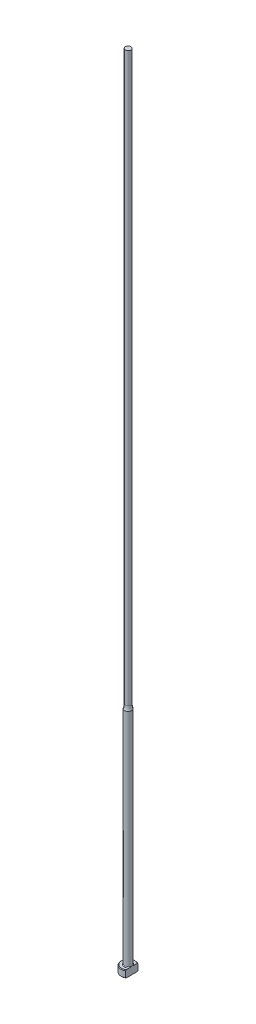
ISO-10303-21;
HEADER;
FILE_DESCRIPTION(('STEP AP214'),'2;1');
FILE_NAME('part.step','',(''),(''),'','','');
FILE_SCHEMA(('AUTOMOTIVE_DESIGN { 1 0 10303 214 1 1 1 1 }'));
ENDSEC;
DATA;
#1=APPLICATION_CONTEXT('core data for automotive mechanical design processes');
#2=APPLICATION_PROTOCOL_DEFINITION('international standard','automotive_design',2000,#1);
#3=PRODUCT_CONTEXT('',#1,'mechanical');
#4=PRODUCT('Part','Part','',(#3));
#5=PRODUCT_RELATED_PRODUCT_CATEGORY('part','',(#4));
#6=PRODUCT_DEFINITION_FORMATION('','',#4);
#7=PRODUCT_DEFINITION_CONTEXT('part definition',#1,'design');
#8=PRODUCT_DEFINITION('design','',#6,#7);
#9=PRODUCT_DEFINITION_SHAPE('','',#8);
#10=(LENGTH_UNIT() NAMED_UNIT(*) SI_UNIT(.MILLI.,.METRE.));
#11=(NAMED_UNIT(*) PLANE_ANGLE_UNIT() SI_UNIT($,.RADIAN.));
#12=(NAMED_UNIT(*) SI_UNIT($,.STERADIAN.) SOLID_ANGLE_UNIT());
#13=UNCERTAINTY_MEASURE_WITH_UNIT(LENGTH_MEASURE(1.E-05),#10,'distance_accuracy_value','');
#14=(GEOMETRIC_REPRESENTATION_CONTEXT(3) GLOBAL_UNCERTAINTY_ASSIGNED_CONTEXT((#13)) GLOBAL_UNIT_ASSIGNED_CONTEXT((#10,
#11,#12)) REPRESENTATION_CONTEXT('',''));
#15=CARTESIAN_POINT('',(0.,0.,0.));
#16=DIRECTION('',(0.,0.,1.));
#17=DIRECTION('',(1.,0.,0.));
#18=AXIS2_PLACEMENT_3D('',#15,#16,#17);
#19=CARTESIAN_POINT('',(-3.17499999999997,3.175,0.));
#20=DIRECTION('',(0.,1.,0.));
#21=DIRECTION('',(0.,0.,1.));
#22=AXIS2_PLACEMENT_3D('',#19,#20,#21);
#23=PLANE('',#22);
#24=CARTESIAN_POINT('',(0.,3.175,0.));
#25=DIRECTION('',(0.,1.,0.));
#26=DIRECTION('',(0.,0.,1.));
#27=AXIS2_PLACEMENT_3D('',#24,#25,#26);
#28=CIRCLE('',#27,2.92099999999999);
#29=CARTESIAN_POINT('',(1.58749999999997,3.175,-2.4519552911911));
#30=VERTEX_POINT('',#29);
#31=CARTESIAN_POINT('',(1.58749999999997,3.175,2.4519552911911));
#32=VERTEX_POINT('',#31);
#33=EDGE_CURVE('E105',#30,#32,#28,.T.);
#34=ORIENTED_EDGE('',*,*,#33,.T.);
#35=DIRECTION('',(0.,0.,1.));
#36=VECTOR('',#35,1.);
#37=CARTESIAN_POINT('',(1.58749999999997,3.17499999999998,2.74963065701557));
#38=LINE('',#37,#36);
#39=CARTESIAN_POINT('',(1.58749999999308,3.175,0.933255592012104));
#40=VERTEX_POINT('',#39);
#41=EDGE_CURVE('E126',#40,#32,#38,.T.);
#42=ORIENTED_EDGE('',*,*,#41,.F.);
#43=CARTESIAN_POINT('',(0.,3.175,0.));
#44=DIRECTION('',(0.,1.,0.));
#45=DIRECTION('',(0.,0.,1.));
#46=AXIS2_PLACEMENT_3D('',#43,#44,#45);
#47=CIRCLE('',#46,1.84149999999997);
#48=CARTESIAN_POINT('',(1.58749999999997,3.17500000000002,-0.933255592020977));
#49=VERTEX_POINT('',#48);
#50=EDGE_CURVE('E11',#40,#49,#47,.F.);
#51=ORIENTED_EDGE('',*,*,#50,.T.);
#52=EDGE_CURVE('E52',#30,#49,#38,.T.);
#53=ORIENTED_EDGE('',*,*,#52,.F.);
#54=EDGE_LOOP('',(#34,#42,#51,#53));
#55=FACE_BOUND('',#54,.T.);
#56=ADVANCED_FACE('F32',(#55),#23,.T.);
#57=CARTESIAN_POINT('',(0.,259.958771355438,0.));
#58=DIRECTION('',(0.,1.,0.));
#59=DIRECTION('',(0.,0.,1.));
#60=AXIS2_PLACEMENT_3D('',#57,#58,#59);
#61=CYLINDRICAL_SURFACE('',#60,3.17499999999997);
#62=CARTESIAN_POINT('',(0.,2.92100000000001,0.));
#63=DIRECTION('',(0.,1.,0.));
#64=DIRECTION('',(0.,0.,1.));
#65=AXIS2_PLACEMENT_3D('',#62,#63,#64);
#66=CIRCLE('',#65,3.17499999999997);
#67=CARTESIAN_POINT('',(1.58749999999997,2.92100000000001,2.74963065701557));
#68=VERTEX_POINT('',#67);
#69=CARTESIAN_POINT('',(1.58749999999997,2.92100000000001,-2.74963065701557));
#70=VERTEX_POINT('',#69);
#71=EDGE_CURVE('E98',#68,#70,#66,.F.);
#72=ORIENTED_EDGE('',*,*,#71,.T.);
#73=DIRECTION('',(0.,-1.,0.));
#74=VECTOR('',#73,1.);
#75=CARTESIAN_POINT('',(1.58749999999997,355.601,-2.74963065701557));
#76=LINE('',#75,#74);
#77=CARTESIAN_POINT('',(1.58749999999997,0.253999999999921,-2.74963065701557));
#78=VERTEX_POINT('',#77);
#79=EDGE_CURVE('E141',#70,#78,#76,.T.);
#80=ORIENTED_EDGE('',*,*,#79,.T.);
#81=CARTESIAN_POINT('',(0.,0.253999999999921,0.));
#82=DIRECTION('',(0.,-1.,0.));
#83=DIRECTION('',(0.,0.,-1.));
#84=AXIS2_PLACEMENT_3D('',#81,#82,#83);
#85=CIRCLE('',#84,3.17499999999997);
#86=CARTESIAN_POINT('',(1.58749999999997,0.253999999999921,2.74963065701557));
#87=VERTEX_POINT('',#86);
#88=EDGE_CURVE('E95',#78,#87,#85,.F.);
#89=ORIENTED_EDGE('',*,*,#88,.T.);
#90=DIRECTION('',(0.,-1.,0.));
#91=VECTOR('',#90,1.);
#92=CARTESIAN_POINT('',(1.58749999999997,355.601,2.74963065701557));
#93=LINE('',#92,#91);
#94=EDGE_CURVE('E88',#68,#87,#93,.T.);
#95=ORIENTED_EDGE('',*,*,#94,.F.);
#96=EDGE_LOOP('',(#72,#80,#89,#95));
#97=FACE_BOUND('',#96,.T.);
#98=ADVANCED_FACE('F191',(#97),#61,.T.);
#99=CARTESIAN_POINT('',(0.,0.,0.));
#100=DIRECTION('',(0.,-1.,0.));
#101=DIRECTION('',(0.,0.,-1.));
#102=AXIS2_PLACEMENT_3D('',#99,#100,#101);
#103=PLANE('',#102);
#104=CARTESIAN_POINT('',(0.,0.,0.));
#105=DIRECTION('',(0.,-1.,0.));
#106=DIRECTION('',(0.,0.,-1.));
#107=AXIS2_PLACEMENT_3D('',#104,#105,#106);
#108=CIRCLE('',#107,2.92100000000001);
#109=CARTESIAN_POINT('',(1.58749999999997,0.,2.45195529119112));
#110=VERTEX_POINT('',#109);
#111=CARTESIAN_POINT('',(1.58749999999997,0.,-2.45195529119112));
#112=VERTEX_POINT('',#111);
#113=EDGE_CURVE('E93',#110,#112,#108,.T.);
#114=ORIENTED_EDGE('',*,*,#113,.T.);
#115=DIRECTION('',(0.,0.,1.));
#116=VECTOR('',#115,1.);
#117=CARTESIAN_POINT('',(1.58749999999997,0.,2.74963065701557));
#118=LINE('',#117,#116);
#119=EDGE_CURVE('E78',#112,#110,#118,.T.);
#120=ORIENTED_EDGE('',*,*,#119,.T.);
#121=EDGE_LOOP('',(#114,#120));
#122=FACE_BOUND('',#121,.T.);
#123=ADVANCED_FACE('F97',(#122),#103,.T.);
#124=CARTESIAN_POINT('',(0.,3.17499999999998,0.));
#125=DIRECTION('',(0.,-1.,0.));
#126=DIRECTION('',(0.,0.,-1.));
#127=AXIS2_PLACEMENT_3D('',#124,#125,#126);
#128=CONICAL_SURFACE('',#127,2.92100000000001,0.785398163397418);
#129=ORIENTED_EDGE('',*,*,#71,.F.);
#130=CARTESIAN_POINT('',(1.58749999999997,-0.161620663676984,-6.0529050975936));
#131=CARTESIAN_POINT('',(1.58749999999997,-0.0288893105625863,-5.91567682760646));
#132=CARTESIAN_POINT('',(1.58749999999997,0.103699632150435,-5.77831035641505));
#133=CARTESIAN_POINT('',(1.58749999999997,0.368508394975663,-5.50321874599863));
#134=CARTESIAN_POINT('',(1.58749999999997,0.5007282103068,-5.3654936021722));
#135=CARTESIAN_POINT('',(1.58749999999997,0.764778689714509,-5.08953516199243));
#136=CARTESIAN_POINT('',(1.58749999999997,0.896609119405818,-4.95130164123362));
#137=CARTESIAN_POINT('',(1.58749999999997,1.15968706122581,-4.67428233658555));
#138=CARTESIAN_POINT('',(1.58749999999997,1.29093457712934,-4.5354965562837));
#139=CARTESIAN_POINT('',(1.58749999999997,1.55007705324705,-4.25997724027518));
#140=CARTESIAN_POINT('',(1.58749999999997,1.67798684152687,-4.12325766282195));
#141=CARTESIAN_POINT('',(1.58749999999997,1.9328486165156,-3.84892898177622));
#142=CARTESIAN_POINT('',(1.58749999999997,2.05980060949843,-3.71131988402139));
#143=CARTESIAN_POINT('',(1.58749999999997,2.31237508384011,-3.43493978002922));
#144=CARTESIAN_POINT('',(1.58749999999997,2.43799784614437,-3.29616903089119));
#145=CARTESIAN_POINT('',(1.58749999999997,2.68741369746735,-3.01699558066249));
#146=CARTESIAN_POINT('',(1.58749999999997,2.81120686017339,-2.8765929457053));
#147=CARTESIAN_POINT('',(1.58749999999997,3.00875865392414,-2.64816703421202));
#148=CARTESIAN_POINT('',(1.58749999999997,3.08336151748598,-2.56087478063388));
#149=CARTESIAN_POINT('',(1.58749999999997,3.23123871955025,-2.385154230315));
#150=CARTESIAN_POINT('',(1.58749999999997,3.30451292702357,-2.29672582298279));
#151=CARTESIAN_POINT('',(1.58749999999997,3.45004422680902,-2.11747400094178));
#152=CARTESIAN_POINT('',(1.58749999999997,3.52228237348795,-2.02663514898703));
#153=CARTESIAN_POINT('',(1.58749999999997,3.66423097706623,-1.84302524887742));
#154=CARTESIAN_POINT('',(1.58749999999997,3.73394203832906,-1.75025467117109));
#155=CARTESIAN_POINT('',(1.58749999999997,3.87080633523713,-1.56067475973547));
#156=CARTESIAN_POINT('',(1.58749999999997,3.93790459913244,-1.46382547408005));
#157=CARTESIAN_POINT('',(1.58749999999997,4.06669147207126,-1.26632594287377));
#158=CARTESIAN_POINT('',(1.58749999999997,4.12837264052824,-1.16567073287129));
#159=CARTESIAN_POINT('',(1.58749999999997,4.21402252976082,-1.01165766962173));
#160=CARTESIAN_POINT('',(1.58749999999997,4.2412792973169,-0.960142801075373));
#161=CARTESIAN_POINT('',(1.58749999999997,4.29309798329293,-0.85578092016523));
#162=CARTESIAN_POINT('',(1.58749999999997,4.3176594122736,-0.802933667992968));
#163=CARTESIAN_POINT('',(1.58749999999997,4.38614656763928,-0.642461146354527));
#164=CARTESIAN_POINT('',(1.58749999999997,4.42510149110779,-0.532518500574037));
#165=CARTESIAN_POINT('',(1.58749999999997,4.46726244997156,-0.367680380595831));
#166=CARTESIAN_POINT('',(1.58749999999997,4.47844427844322,-0.314802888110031));
#167=CARTESIAN_POINT('',(1.58749999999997,4.49576654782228,-0.208209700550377));
#168=CARTESIAN_POINT('',(1.58749999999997,4.50190743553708,-0.154494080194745));
#169=CARTESIAN_POINT('',(1.58749999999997,4.50871296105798,-0.0468792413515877));
#170=CARTESIAN_POINT('',(1.58749999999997,4.50939451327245,0.00701889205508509));
#171=CARTESIAN_POINT('',(1.58749999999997,4.5052767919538,0.114606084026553));
#172=CARTESIAN_POINT('',(1.58749999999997,4.5004770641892,0.16829512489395));
#173=CARTESIAN_POINT('',(1.58749999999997,4.48579689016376,0.274485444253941));
#174=CARTESIAN_POINT('',(1.58749999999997,4.47596081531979,0.326992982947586));
#175=CARTESIAN_POINT('',(1.58749999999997,4.4518180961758,0.430974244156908));
#176=CARTESIAN_POINT('',(1.58749999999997,4.43750969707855,0.482447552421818));
#177=CARTESIAN_POINT('',(1.58749999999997,4.40502489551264,0.58446088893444));
#178=CARTESIAN_POINT('',(1.58749999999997,4.38682724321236,0.634994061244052));
#179=CARTESIAN_POINT('',(1.58749999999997,4.34729308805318,0.734789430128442));
#180=CARTESIAN_POINT('',(1.58749999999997,4.32595722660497,0.784051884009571));
#181=CARTESIAN_POINT('',(1.58749999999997,4.25791922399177,0.93054934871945));
#182=CARTESIAN_POINT('',(1.58749999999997,4.20736047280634,1.02598802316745));
#183=CARTESIAN_POINT('',(1.58749999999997,4.09955451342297,1.21304313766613));
#184=CARTESIAN_POINT('',(1.58749999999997,4.04229912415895,1.30465471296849));
#185=CARTESIAN_POINT('',(1.58749999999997,3.92308746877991,1.48526211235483));
#186=CARTESIAN_POINT('',(1.58749999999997,3.86111349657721,1.57424615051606));
#187=CARTESIAN_POINT('',(1.58749999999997,3.73408621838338,1.74990003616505));
#188=CARTESIAN_POINT('',(1.58749999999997,3.66903444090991,1.83657099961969));
#189=CARTESIAN_POINT('',(1.58749999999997,3.53583371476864,2.009317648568));
#190=CARTESIAN_POINT('',(1.58749999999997,3.46765527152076,2.09537048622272));
#191=CARTESIAN_POINT('',(1.58749999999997,3.32960643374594,2.26611736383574));
#192=CARTESIAN_POINT('',(1.58749999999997,3.25973586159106,2.35081125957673));
#193=CARTESIAN_POINT('',(1.58749999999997,3.04858139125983,2.60290121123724));
#194=CARTESIAN_POINT('',(1.58749999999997,2.90542388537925,2.7687253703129));
#195=CARTESIAN_POINT('',(1.58749999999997,2.64069522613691,3.06970913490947));
#196=CARTESIAN_POINT('',(1.58749999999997,2.5195945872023,3.20528660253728));
#197=CARTESIAN_POINT('',(1.58749999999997,2.27590400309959,3.47510321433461));
#198=CARTESIAN_POINT('',(1.58749999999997,2.1533140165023,3.60934232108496));
#199=CARTESIAN_POINT('',(1.58749999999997,1.9069423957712,3.87695374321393));
#200=CARTESIAN_POINT('',(1.58749999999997,1.78315974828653,4.01032512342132));
#201=CARTESIAN_POINT('',(1.58749999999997,1.53478104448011,4.2763088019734));
#202=CARTESIAN_POINT('',(1.58749999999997,1.41018498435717,4.40892109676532));
#203=CARTESIAN_POINT('',(1.58749999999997,1.04574684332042,4.79499418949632));
#204=CARTESIAN_POINT('',(1.58749999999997,0.805076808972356,5.04767313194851));
#205=CARTESIAN_POINT('',(1.58749999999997,0.44312150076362,5.42550911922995));
#206=CARTESIAN_POINT('',(1.58749999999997,0.322378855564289,5.55118772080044));
#207=CARTESIAN_POINT('',(1.58749999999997,0.0805914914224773,5.8022520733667));
#208=CARTESIAN_POINT('',(1.58749999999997,-0.0404532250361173,5.92763782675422));
#209=CARTESIAN_POINT('',(1.58749999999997,-0.161620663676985,6.0529050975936));
#210=B_SPLINE_CURVE_WITH_KNOTS('',3,(#130,#131,#132,#133,#134,#135,#136,#137,#138,#139,#140,
#141,#142,#143,#144,#145,#146,#147,#148,#149,#150,#151,#152,#153,#154,#155,#156,#157,#158,#159,
#160,#161,#162,#163,#164,#165,#166,#167,#168,#169,#170,#171,#172,#173,#174,#175,#176,#177,#178,
#179,#180,#181,#182,#183,#184,#185,#186,#187,#188,#189,#190,#191,#192,#193,#194,#195,#196,#197,
#198,#199,#200,#201,#202,#203,#204,#205,#206,#207,#208,#209),.UNSPECIFIED.,.F.,.F.,(4,2,2,2,2,2,
2,2,2,2,2,2,2,2,2,2,2,2,2,2,2,2,2,2,2,2,2,2,2,2,2,2,2,2,2,2,2,2,2,4),(0.,0.572750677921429,
1.14550874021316,1.71856057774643,2.29160869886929,2.85328006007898,3.41494773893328,
3.97649423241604,4.53801804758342,4.88249307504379,5.2270018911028,5.57515326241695,
5.92322081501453,6.27657800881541,6.63041319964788,6.80518126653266,6.97998101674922,
7.32824262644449,7.49018491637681,7.65211285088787,7.81353889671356,7.97497832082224,
8.13501929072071,8.29512313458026,8.45612518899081,8.61709438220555,8.94062993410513,
9.26456495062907,9.58978187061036,9.91483894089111,10.2441741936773,10.5735441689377,
11.2306812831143,11.7760337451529,12.3214014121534,12.8672825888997,13.4131663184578,
14.4600164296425,14.9828595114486,15.505698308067),.UNSPECIFIED.);
#211=EDGE_CURVE('E118',#32,#68,#210,.T.);
#212=ORIENTED_EDGE('',*,*,#211,.F.);
#213=ORIENTED_EDGE('',*,*,#33,.F.);
#214=EDGE_CURVE('E117',#70,#30,#210,.T.);
#215=ORIENTED_EDGE('',*,*,#214,.F.);
#216=EDGE_LOOP('',(#129,#212,#213,#215));
#217=FACE_BOUND('',#216,.T.);
#218=ADVANCED_FACE('F162',(#217),#128,.T.);
#219=CARTESIAN_POINT('',(0.,0.253999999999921,0.));
#220=DIRECTION('',(0.,1.,0.));
#221=DIRECTION('',(0.,0.,1.));
#222=AXIS2_PLACEMENT_3D('',#219,#220,#221);
#223=CONICAL_SURFACE('',#222,3.17499999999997,0.785398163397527);
#224=ORIENTED_EDGE('',*,*,#88,.F.);
#225=CARTESIAN_POINT('',(1.58749999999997,3.33662066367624,6.0529050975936));
#226=CARTESIAN_POINT('',(1.58749999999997,3.20388931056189,5.91567682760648));
#227=CARTESIAN_POINT('',(1.58749999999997,3.07130036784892,5.7783103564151));
#228=CARTESIAN_POINT('',(1.58749999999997,2.80649160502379,5.50321874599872));
#229=CARTESIAN_POINT('',(1.58749999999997,2.6742717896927,5.36549360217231));
#230=CARTESIAN_POINT('',(1.58749999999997,2.41022131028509,5.08953516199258));
#231=CARTESIAN_POINT('',(1.58749999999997,2.27839088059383,4.95130164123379));
#232=CARTESIAN_POINT('',(1.58749999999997,2.01531293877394,4.67428233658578));
#233=CARTESIAN_POINT('',(1.58749999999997,1.88406542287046,4.53549655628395));
#234=CARTESIAN_POINT('',(1.58749999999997,1.62492294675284,4.25997724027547));
#235=CARTESIAN_POINT('',(1.58749999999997,1.49701315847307,4.12325766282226));
#236=CARTESIAN_POINT('',(1.58749999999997,1.24215138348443,3.84892898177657));
#237=CARTESIAN_POINT('',(1.58749999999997,1.11519939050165,3.71131988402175));
#238=CARTESIAN_POINT('',(1.58749999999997,0.862624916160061,3.43493978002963));
#239=CARTESIAN_POINT('',(1.58749999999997,0.737002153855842,3.29616903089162));
#240=CARTESIAN_POINT('',(1.58749999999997,0.487586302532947,3.01699558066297));
#241=CARTESIAN_POINT('',(1.58749999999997,0.363793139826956,2.8765929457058));
#242=CARTESIAN_POINT('',(1.58749999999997,0.166241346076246,2.64816703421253));
#243=CARTESIAN_POINT('',(1.58749999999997,0.0916384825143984,2.56087478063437));
#244=CARTESIAN_POINT('',(1.58749999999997,-0.0562387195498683,2.38515423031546));
#245=CARTESIAN_POINT('',(1.58749999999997,-0.129512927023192,2.29672582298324));
#246=CARTESIAN_POINT('',(1.58749999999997,-0.275044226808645,2.1174740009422));
#247=CARTESIAN_POINT('',(1.58749999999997,-0.347282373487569,2.02663514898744));
#248=CARTESIAN_POINT('',(1.58749999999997,-0.489230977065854,1.8430252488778));
#249=CARTESIAN_POINT('',(1.58749999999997,-0.558942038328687,1.75025467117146));
#250=CARTESIAN_POINT('',(1.58749999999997,-0.695806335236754,1.5606747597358));
#251=CARTESIAN_POINT('',(1.58749999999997,-0.762904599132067,1.46382547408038));
#252=CARTESIAN_POINT('',(1.58749999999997,-0.89169147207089,1.26632594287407));
#253=CARTESIAN_POINT('',(1.58749999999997,-0.953372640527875,1.16567073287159));
#254=CARTESIAN_POINT('',(1.58749999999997,-1.03902252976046,1.01165766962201));
#255=CARTESIAN_POINT('',(1.58749999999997,-1.06627929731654,0.960142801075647));
#256=CARTESIAN_POINT('',(1.58749999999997,-1.11809798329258,0.855780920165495));
#257=CARTESIAN_POINT('',(1.58749999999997,-1.14265941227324,0.802933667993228));
#258=CARTESIAN_POINT('',(1.58749999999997,-1.21114656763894,0.642461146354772));
#259=CARTESIAN_POINT('',(1.58749999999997,-1.25010149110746,0.532518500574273));
#260=CARTESIAN_POINT('',(1.58749999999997,-1.29226244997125,0.367680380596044));
#261=CARTESIAN_POINT('',(1.58749999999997,-1.30344427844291,0.314802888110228));
#262=CARTESIAN_POINT('',(1.58749999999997,-1.32076654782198,0.208209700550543));
#263=CARTESIAN_POINT('',(1.58749999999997,-1.32690743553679,0.154494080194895));
#264=CARTESIAN_POINT('',(1.58749999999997,-1.3337129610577,0.0468792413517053));
#265=CARTESIAN_POINT('',(1.58749999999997,-1.33439451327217,-0.00701889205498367));
#266=CARTESIAN_POINT('',(1.58749999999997,-1.33027679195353,-0.114606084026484));
#267=CARTESIAN_POINT('',(1.58749999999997,-1.32547706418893,-0.168295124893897));
#268=CARTESIAN_POINT('',(1.58749999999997,-1.31079689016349,-0.274485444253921));
#269=CARTESIAN_POINT('',(1.58749999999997,-1.30096081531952,-0.326992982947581));
#270=CARTESIAN_POINT('',(1.58749999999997,-1.27681809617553,-0.430974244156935));
#271=CARTESIAN_POINT('',(1.58749999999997,-1.26250969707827,-0.48244755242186));
#272=CARTESIAN_POINT('',(1.58749999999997,-1.23002489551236,-0.584460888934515));
#273=CARTESIAN_POINT('',(1.58749999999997,-1.21182724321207,-0.634994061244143));
#274=CARTESIAN_POINT('',(1.58749999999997,-1.17229308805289,-0.734789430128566));
#275=CARTESIAN_POINT('',(1.58749999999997,-1.15095722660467,-0.784051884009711));
#276=CARTESIAN_POINT('',(1.58749999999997,-1.08291922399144,-0.930549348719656));
#277=CARTESIAN_POINT('',(1.58749999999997,-1.03236047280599,-1.0259880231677));
#278=CARTESIAN_POINT('',(1.58749999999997,-0.924554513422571,-1.21304313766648));
#279=CARTESIAN_POINT('',(1.58749999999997,-0.867299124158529,-1.30465471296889));
#280=CARTESIAN_POINT('',(1.58749999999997,-0.748087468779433,-1.48526211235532));
#281=CARTESIAN_POINT('',(1.58749999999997,-0.686113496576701,-1.5742461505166));
#282=CARTESIAN_POINT('',(1.58749999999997,-0.559086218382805,-1.74990003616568));
#283=CARTESIAN_POINT('',(1.58749999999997,-0.494034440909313,-1.83657099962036));
#284=CARTESIAN_POINT('',(1.58749999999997,-0.360833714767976,-2.00931764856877));
#285=CARTESIAN_POINT('',(1.58749999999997,-0.292655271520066,-2.09537048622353));
#286=CARTESIAN_POINT('',(1.58749999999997,-0.154606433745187,-2.26611736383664));
#287=CARTESIAN_POINT('',(1.58749999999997,-0.0847358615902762,-2.35081125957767));
#288=CARTESIAN_POINT('',(1.58749999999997,0.126418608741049,-2.60290121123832));
#289=CARTESIAN_POINT('',(1.58749999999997,0.269576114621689,-2.76872537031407));
#290=CARTESIAN_POINT('',(1.58749999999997,0.534304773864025,-3.06970913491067));
#291=CARTESIAN_POINT('',(1.58749999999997,0.655405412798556,-3.20528660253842));
#292=CARTESIAN_POINT('',(1.58749999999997,0.899095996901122,-3.47510321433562));
#293=CARTESIAN_POINT('',(1.58749999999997,1.02168598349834,-3.60934232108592));
#294=CARTESIAN_POINT('',(1.58749999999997,1.26805760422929,-3.87695374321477));
#295=CARTESIAN_POINT('',(1.58749999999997,1.39184025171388,-4.0103251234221));
#296=CARTESIAN_POINT('',(1.58749999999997,1.64021895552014,-4.27630880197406));
#297=CARTESIAN_POINT('',(1.58749999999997,1.76481501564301,-4.40892109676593));
#298=CARTESIAN_POINT('',(1.58749999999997,2.12925315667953,-4.79499418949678));
#299=CARTESIAN_POINT('',(1.58749999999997,2.36992319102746,-5.04767313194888));
#300=CARTESIAN_POINT('',(1.58749999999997,2.73187849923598,-5.42550911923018));
#301=CARTESIAN_POINT('',(1.58749999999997,2.85262114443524,-5.55118772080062));
#302=CARTESIAN_POINT('',(1.58749999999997,3.09440850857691,-5.80225207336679));
#303=CARTESIAN_POINT('',(1.58749999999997,3.21545322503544,-5.92763782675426));
#304=CARTESIAN_POINT('',(1.58749999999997,3.33662066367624,-6.0529050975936));
#305=B_SPLINE_CURVE_WITH_KNOTS('',3,(#225,#226,#227,#228,#229,#230,#231,#232,#233,#234,#235,
#236,#237,#238,#239,#240,#241,#242,#243,#244,#245,#246,#247,#248,#249,#250,#251,#252,#253,#254,
#255,#256,#257,#258,#259,#260,#261,#262,#263,#264,#265,#266,#267,#268,#269,#270,#271,#272,#273,
#274,#275,#276,#277,#278,#279,#280,#281,#282,#283,#284,#285,#286,#287,#288,#289,#290,#291,#292,
#293,#294,#295,#296,#297,#298,#299,#300,#301,#302,#303,#304),.UNSPECIFIED.,.F.,.F.,(4,2,2,2,2,2,
2,2,2,2,2,2,2,2,2,2,2,2,2,2,2,2,2,2,2,2,2,2,2,2,2,2,2,2,2,2,2,2,2,4),(0.,0.572750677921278,
1.14550874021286,1.71856057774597,2.29160869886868,2.85328006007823,3.4149477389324,
3.97649423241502,4.53801804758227,4.88249307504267,5.22700189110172,5.5751532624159,
5.92322081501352,6.27657800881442,6.63041319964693,6.80518126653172,6.9799810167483,
7.3282426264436,7.49018491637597,7.65211285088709,7.81353889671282,7.97497832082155,
8.13501929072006,8.29512313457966,8.45612518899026,8.61709438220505,8.9406299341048,
9.2645649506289,9.58978187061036,9.91483894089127,10.2441741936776,10.5735441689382,
11.2306812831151,11.7760337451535,12.3214014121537,12.8672825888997,13.4131663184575,
14.4600164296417,14.9828595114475,15.5056983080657),.UNSPECIFIED.);
#306=EDGE_CURVE('E81',#112,#78,#305,.T.);
#307=ORIENTED_EDGE('',*,*,#306,.F.);
#308=ORIENTED_EDGE('',*,*,#113,.F.);
#309=EDGE_CURVE('E84',#87,#110,#305,.T.);
#310=ORIENTED_EDGE('',*,*,#309,.F.);
#311=EDGE_LOOP('',(#224,#307,#308,#310));
#312=FACE_BOUND('',#311,.T.);
#313=ADVANCED_FACE('F92',(#312),#223,.T.);
#314=CARTESIAN_POINT('',(0.,3.42900000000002,0.));
#315=DIRECTION('',(0.,1.,0.));
#316=DIRECTION('',(0.,0.,1.));
#317=AXIS2_PLACEMENT_3D('',#314,#315,#316);
#318=TOROIDAL_SURFACE('',#317,1.84149999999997,0.254);
#319=CARTESIAN_POINT('',(1.58749999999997,3.42900000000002,0.));
#320=CARTESIAN_POINT('',(1.58749999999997,3.42899942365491,-1.9220514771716E-10));
#321=CARTESIAN_POINT('',(1.58749999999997,3.42899884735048,-1.2261161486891E-07));
#322=CARTESIAN_POINT('',(1.58749999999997,3.42899773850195,-5.09676365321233E-07));
#323=CARTESIAN_POINT('',(1.58749999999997,3.42899720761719,-7.78176328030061E-07));
#324=CARTESIAN_POINT('',(1.58749999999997,3.42899614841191,-1.42307272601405E-06));
#325=CARTESIAN_POINT('',(1.58749999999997,3.42899562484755,-1.80713867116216E-06));
#326=CARTESIAN_POINT('',(1.58749999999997,3.42899463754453,-2.63494846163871E-06));
#327=CARTESIAN_POINT('',(1.58749999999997,3.42899417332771,-3.07814756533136E-06));
#328=CARTESIAN_POINT('',(1.58749999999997,3.42899261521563,-4.66897357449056E-06));
#329=CARTESIAN_POINT('',(1.58749999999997,3.42899159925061,-5.89404908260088E-06));
#330=CARTESIAN_POINT('',(1.58749999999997,3.42898979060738,-8.42427511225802E-06));
#331=CARTESIAN_POINT('',(1.58749999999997,3.42898899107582,-9.7248057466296E-06));
#332=CARTESIAN_POINT('',(1.58749999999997,3.42898598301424,-1.48060601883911E-05));
#333=CARTESIAN_POINT('',(1.58749999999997,3.42898393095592,-1.86838281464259E-05));
#334=CARTESIAN_POINT('',(1.58749999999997,3.42898057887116,-2.63261117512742E-05));
#335=CARTESIAN_POINT('',(1.58749999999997,3.42897922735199,-3.00687417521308E-05));
#336=CARTESIAN_POINT('',(1.58749999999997,3.42897347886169,-4.60276298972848E-05));
#337=CARTESIAN_POINT('',(1.58749999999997,3.42896911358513,-5.8247019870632E-05));
#338=CARTESIAN_POINT('',(1.58749999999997,3.42896211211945,-8.11070097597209E-05));
#339=CARTESIAN_POINT('',(1.58749999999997,3.42895931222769,-9.16953114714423E-05));
#340=CARTESIAN_POINT('',(1.58749999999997,3.42893712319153,-0.000168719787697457));
#341=CARTESIAN_POINT('',(1.58749999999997,3.42890881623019,-0.000232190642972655));
#342=CARTESIAN_POINT('',(1.58749999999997,3.42880276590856,-0.000479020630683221));
#343=CARTESIAN_POINT('',(1.58749999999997,3.42873165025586,-0.00066443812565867));
#344=CARTESIAN_POINT('',(1.58749999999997,3.42845137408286,-0.0013844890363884));
#345=CARTESIAN_POINT('',(1.58749999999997,3.42823526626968,-0.00191701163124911));
#346=CARTESIAN_POINT('',(1.58749999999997,3.42735449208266,-0.00409774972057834));
#347=CARTESIAN_POINT('',(1.58749999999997,3.42669768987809,-0.00574830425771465));
#348=CARTESIAN_POINT('',(1.58749999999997,3.4174405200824,-0.0289985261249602));
#349=CARTESIAN_POINT('',(1.58749999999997,3.40878325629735,-0.0505816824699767));
#350=CARTESIAN_POINT('',(1.58749999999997,3.39189297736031,-0.0929947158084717));
#351=CARTESIAN_POINT('',(1.58749999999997,3.38365605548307,-0.11382315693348));
#352=CARTESIAN_POINT('',(1.58749999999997,3.36635393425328,-0.157956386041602));
#353=CARTESIAN_POINT('',(1.58749999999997,3.35730391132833,-0.181267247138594));
#354=CARTESIAN_POINT('',(1.58749999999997,3.33936775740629,-0.228222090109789));
#355=CARTESIAN_POINT('',(1.58749999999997,3.33048420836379,-0.25186705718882));
#356=CARTESIAN_POINT('',(1.58749999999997,3.30894496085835,-0.310512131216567));
#357=CARTESIAN_POINT('',(1.58749999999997,3.29649449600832,-0.345588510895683));
#358=CARTESIAN_POINT('',(1.58749999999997,3.27296975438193,-0.415278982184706));
#359=CARTESIAN_POINT('',(1.58749999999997,3.26186987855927,-0.449884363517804));
#360=CARTESIAN_POINT('',(1.58749999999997,3.2395832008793,-0.524471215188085));
#361=CARTESIAN_POINT('',(1.58749999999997,3.22860862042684,-0.564517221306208));
#362=CARTESIAN_POINT('',(1.58749999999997,3.20902534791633,-0.645529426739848));
#363=CARTESIAN_POINT('',(1.58749999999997,3.20043582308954,-0.686500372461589));
#364=CARTESIAN_POINT('',(1.58749999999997,3.18611712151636,-0.771546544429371));
#365=CARTESIAN_POINT('',(1.58749999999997,3.18059550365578,-0.815658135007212));
#366=CARTESIAN_POINT('',(1.58749999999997,3.17455396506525,-0.904117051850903));
#367=CARTESIAN_POINT('',(1.58749999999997,3.17401361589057,-0.948462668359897));
#368=CARTESIAN_POINT('',(1.58749999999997,3.17898948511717,-1.02531896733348));
#369=CARTESIAN_POINT('',(1.58749999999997,3.1829739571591,-1.05792141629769));
#370=CARTESIAN_POINT('',(1.58749999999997,3.19569167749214,-1.12184393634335));
#371=CARTESIAN_POINT('',(1.58749999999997,3.20436049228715,-1.1531753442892));
#372=CARTESIAN_POINT('',(1.58749999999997,3.22236152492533,-1.19946468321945));
#373=CARTESIAN_POINT('',(1.58749999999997,3.2295150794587,-1.21526783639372));
#374=CARTESIAN_POINT('',(1.58749999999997,3.24587062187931,-1.24583726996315));
#375=CARTESIAN_POINT('',(1.58749999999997,3.25507530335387,-1.26060215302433));
#376=CARTESIAN_POINT('',(1.58749999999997,3.27378481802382,-1.28575815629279));
#377=CARTESIAN_POINT('',(1.58749999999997,3.28289001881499,-1.29644383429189));
#378=CARTESIAN_POINT('',(1.58749999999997,3.30268460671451,-1.31623154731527));
#379=CARTESIAN_POINT('',(1.58749999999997,3.31337067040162,-1.32533681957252));
#380=CARTESIAN_POINT('',(1.58749999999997,3.33349977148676,-1.33941140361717));
#381=CARTESIAN_POINT('',(1.58749999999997,3.34261446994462,-1.34484814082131));
#382=CARTESIAN_POINT('',(1.58749999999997,3.36161455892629,-1.35416329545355));
#383=CARTESIAN_POINT('',(1.58749999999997,3.37149946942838,-1.35804267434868));
#384=CARTESIAN_POINT('',(1.58749999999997,3.39188678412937,-1.36398436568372));
#385=CARTESIAN_POINT('',(1.58749999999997,3.40239309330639,-1.36603350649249));
#386=CARTESIAN_POINT('',(1.58749999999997,3.42360372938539,-1.3680840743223));
#387=CARTESIAN_POINT('',(1.58749999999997,3.43430795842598,-1.36808648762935));
#388=CARTESIAN_POINT('',(1.58749999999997,3.45433283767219,-1.36616208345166));
#389=CARTESIAN_POINT('',(1.58749999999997,3.46367506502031,-1.36444960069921));
#390=CARTESIAN_POINT('',(1.58749999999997,3.48195519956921,-1.35953338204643));
#391=CARTESIAN_POINT('',(1.58749999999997,3.49089304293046,-1.3563294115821));
#392=CARTESIAN_POINT('',(1.58749999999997,3.50850302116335,-1.34848006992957));
#393=CARTESIAN_POINT('',(1.58749999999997,3.5171531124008,-1.34378578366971));
#394=CARTESIAN_POINT('',(1.58749999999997,3.53371257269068,-1.33324445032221));
#395=CARTESIAN_POINT('',(1.58749999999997,3.54162163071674,-1.32739692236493));
#396=CARTESIAN_POINT('',(1.58749999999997,3.56107121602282,-1.31107304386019));
#397=CARTESIAN_POINT('',(1.58749999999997,3.57202221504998,-1.29989286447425));
#398=CARTESIAN_POINT('',(1.58749999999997,3.59202509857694,-1.27593566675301));
#399=CARTESIAN_POINT('',(1.58749999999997,3.60107086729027,-1.26315370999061));
#400=CARTESIAN_POINT('',(1.58749999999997,3.62186023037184,-1.22930733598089));
#401=CARTESIAN_POINT('',(1.58749999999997,3.63240584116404,-1.20751096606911));
#402=CARTESIAN_POINT('',(1.58749999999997,3.65004643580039,-1.16266144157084));
#403=CARTESIAN_POINT('',(1.58749999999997,3.65714435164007,-1.13960937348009));
#404=CARTESIAN_POINT('',(1.58749999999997,3.67265428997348,-1.07603916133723));
#405=CARTESIAN_POINT('',(1.58749999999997,3.67834921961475,-1.03486686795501));
#406=CARTESIAN_POINT('',(1.58749999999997,3.68382880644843,-0.951558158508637));
#407=CARTESIAN_POINT('',(1.58749999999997,3.68350976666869,-0.909417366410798));
#408=CARTESIAN_POINT('',(1.58749999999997,3.67745397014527,-0.811383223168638));
#409=CARTESIAN_POINT('',(1.58749999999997,3.66993873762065,-0.755610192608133));
#410=CARTESIAN_POINT('',(1.58749999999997,3.64933373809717,-0.644937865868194));
#411=CARTESIAN_POINT('',(1.58749999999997,3.63621897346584,-0.59004364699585));
#412=CARTESIAN_POINT('',(1.58749999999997,3.60740922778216,-0.485757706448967));
#413=CARTESIAN_POINT('',(1.58749999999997,3.59201096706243,-0.436281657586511));
#414=CARTESIAN_POINT('',(1.58749999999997,3.55922497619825,-0.338551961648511));
#415=CARTESIAN_POINT('',(1.58749999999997,3.5418584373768,-0.290291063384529));
#416=CARTESIAN_POINT('',(1.58749999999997,3.51760237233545,-0.225557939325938));
#417=CARTESIAN_POINT('',(1.58749999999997,3.51126413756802,-0.208874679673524));
#418=CARTESIAN_POINT('',(1.58749999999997,3.49830042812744,-0.17512392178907));
#419=CARTESIAN_POINT('',(1.58749999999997,3.49167176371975,-0.158057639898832));
#420=CARTESIAN_POINT('',(1.58749999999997,3.47585523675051,-0.117638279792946));
#421=CARTESIAN_POINT('',(1.58749999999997,3.46662970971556,-0.0943002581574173));
#422=CARTESIAN_POINT('',(1.58749999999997,3.44889695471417,-0.0497824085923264));
#423=CARTESIAN_POINT('',(1.58749999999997,3.44040039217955,-0.028598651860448));
#424=CARTESIAN_POINT('',(1.58749999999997,3.43130364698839,-0.00575168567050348));
#425=CARTESIAN_POINT('',(1.58749999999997,3.43064818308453,-0.00410451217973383));
#426=CARTESIAN_POINT('',(1.58749999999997,3.42976776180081,-0.00192459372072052));
#427=CARTESIAN_POINT('',(1.58749999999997,3.42955062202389,-0.00138952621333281));
#428=CARTESIAN_POINT('',(1.58749999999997,3.42926908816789,-0.000666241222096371));
#429=CARTESIAN_POINT('',(1.58749999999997,3.42919771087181,-0.000480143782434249));
#430=CARTESIAN_POINT('',(1.58749999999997,3.42909131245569,-0.000232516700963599));
#431=CARTESIAN_POINT('',(1.58749999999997,3.42906294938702,-0.000168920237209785));
#432=CARTESIAN_POINT('',(1.58749999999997,3.42904072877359,-9.17527162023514E-05));
#433=CARTESIAN_POINT('',(1.58749999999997,3.42903792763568,-8.11550293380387E-05));
#434=CARTESIAN_POINT('',(1.58749999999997,3.42903091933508,-5.82743948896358E-05));
#435=CARTESIAN_POINT('',(1.58749999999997,3.42902654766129,-4.60440001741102E-05));
#436=CARTESIAN_POINT('',(1.58749999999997,3.42902079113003,-3.00727682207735E-05));
#437=CARTESIAN_POINT('',(1.58749999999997,3.42901943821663,-2.63286807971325E-05));
#438=CARTESIAN_POINT('',(1.58749999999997,3.42901608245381,-1.86836529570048E-05));
#439=CARTESIAN_POINT('',(1.58749999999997,3.4290140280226,-1.48046517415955E-05));
#440=CARTESIAN_POINT('',(1.58749999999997,3.42901101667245,-9.72223943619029E-06));
#441=CARTESIAN_POINT('',(1.58749999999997,3.42901021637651,-8.42159649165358E-06));
#442=CARTESIAN_POINT('',(1.58749999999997,3.42900840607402,-5.89129729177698E-06));
#443=CARTESIAN_POINT('',(1.58749999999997,3.42900738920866,-4.66626867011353E-06));
#444=CARTESIAN_POINT('',(1.58749999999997,3.42900582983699,-3.07568803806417E-06));
#445=CARTESIAN_POINT('',(1.58749999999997,3.42900536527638,-2.63259565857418E-06));
#446=CARTESIAN_POINT('',(1.58749999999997,3.4290043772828,-1.80506085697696E-06));
#447=CARTESIAN_POINT('',(1.58749999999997,3.42900385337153,-1.42116387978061E-06));
#448=CARTESIAN_POINT('',(1.58749999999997,3.42900279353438,-7.76675643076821E-07));
#449=CARTESIAN_POINT('',(1.58749999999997,3.42900226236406,-5.08406487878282E-07));
#450=CARTESIAN_POINT('',(1.58749999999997,3.42900115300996,-1.21901887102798E-07));
#451=CARTESIAN_POINT('',(1.58749999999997,3.42900057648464,1.92251677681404E-10));
#452=CARTESIAN_POINT('',(1.58749999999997,3.42900000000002,0.));
#453=B_SPLINE_CURVE_WITH_KNOTS('',3,(#319,#320,#321,#322,#323,#324,#325,#326,#327,#328,#329,
#330,#331,#332,#333,#334,#335,#336,#337,#338,#339,#340,#341,#342,#343,#344,#345,#346,#347,#348,
#349,#350,#351,#352,#353,#354,#355,#356,#357,#358,#359,#360,#361,#362,#363,#364,#365,#366,#367,
#368,#369,#370,#371,#372,#373,#374,#375,#376,#377,#378,#379,#380,#381,#382,#383,#384,#385,#386,
#387,#388,#389,#390,#391,#392,#393,#394,#395,#396,#397,#398,#399,#400,#401,#402,#403,#404,#405,
#406,#407,#408,#409,#410,#411,#412,#413,#414,#415,#416,#417,#418,#419,#420,#421,#422,#423,#424,
#425,#426,#427,#428,#429,#430,#431,#432,#433,#434,#435,#436,#437,#438,#439,#440,#441,#442,#443,
#444,#445,#446,#447,#448,#449,#450,#451,#452),.UNSPECIFIED.,.T.,.F.,(4,2,2,2,2,2,2,2,2,2,2,2,2,
2,2,2,2,2,2,2,2,2,2,2,2,2,2,2,2,2,2,2,2,2,2,2,2,2,2,2,2,2,2,2,2,2,2,2,2,2,2,2,2,2,2,2,2,2,2,2,2,
2,2,2,2,2,4),(0.,1.72815458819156E-06,3.50429255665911E-06,5.44431004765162E-06,
7.3675525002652E-06,1.2119089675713E-05,1.66953775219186E-05,2.98160400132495E-05,
4.17409564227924E-05,8.0660475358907E-05,0.000113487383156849,0.000321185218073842,
0.000917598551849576,0.00264089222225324,0.00797105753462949,0.0777276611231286,
0.144923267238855,0.219939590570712,0.295714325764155,0.407362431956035,0.516367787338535,
0.640878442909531,0.766362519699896,0.899536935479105,1.03216495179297,1.13045740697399,
1.22743103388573,1.27935899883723,1.33135556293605,1.37333248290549,1.41522237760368,
1.44693946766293,1.47863694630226,1.51056074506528,1.54246916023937,1.57083210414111,
1.59919951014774,1.62861579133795,1.65804436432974,1.70472658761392,1.75155645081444,
1.82378709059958,1.89595619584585,2.01995471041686,2.1460932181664,2.31447224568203,
2.48361094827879,2.6389891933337,2.79283011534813,2.84637031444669,2.9012946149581,
2.97658236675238,3.04504771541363,3.05036697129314,3.05209849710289,3.05269709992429,
3.05290520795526,3.05293806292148,3.05297701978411,3.05298895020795,3.05300207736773,
3.05300665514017,3.0530114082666,3.05301333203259,3.05301527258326,3.05301704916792,
3.05301877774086),.UNSPECIFIED.);
#454=CARTESIAN_POINT('',(1.58749999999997,3.42900000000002,0.));
#455=VERTEX_POINT('',#454);
#456=EDGE_CURVE('E47',#455,#49,#453,.T.);
#457=ORIENTED_EDGE('',*,*,#456,.T.);
#458=ORIENTED_EDGE('',*,*,#50,.F.);
#459=CARTESIAN_POINT('',(1.58749999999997,3.42900000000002,0.));
#460=CARTESIAN_POINT('',(1.58749999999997,3.42900057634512,1.9220512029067E-10));
#461=CARTESIAN_POINT('',(1.58749999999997,3.42900115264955,1.22611614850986E-07));
#462=CARTESIAN_POINT('',(1.58749999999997,3.42900226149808,5.09676365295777E-07));
#463=CARTESIAN_POINT('',(1.58749999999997,3.42900279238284,7.78176328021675E-07));
#464=CARTESIAN_POINT('',(1.58749999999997,3.42900385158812,1.42307272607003E-06));
#465=CARTESIAN_POINT('',(1.58749999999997,3.42900437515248,1.80713867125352E-06));
#466=CARTESIAN_POINT('',(1.58749999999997,3.4290053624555,2.63494846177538E-06));
#467=CARTESIAN_POINT('',(1.58749999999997,3.42900582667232,3.0781475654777E-06));
#468=CARTESIAN_POINT('',(1.58749999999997,3.4290073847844,4.66897357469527E-06));
#469=CARTESIAN_POINT('',(1.58749999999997,3.42900840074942,5.89404908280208E-06));
#470=CARTESIAN_POINT('',(1.58749999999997,3.42901020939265,8.42427511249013E-06));
#471=CARTESIAN_POINT('',(1.58749999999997,3.42901100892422,9.72480574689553E-06));
#472=CARTESIAN_POINT('',(1.58749999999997,3.42901401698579,1.48060601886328E-05));
#473=CARTESIAN_POINT('',(1.58749999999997,3.42901606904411,1.86838281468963E-05));
#474=CARTESIAN_POINT('',(1.58749999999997,3.42901942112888,2.63261117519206E-05));
#475=CARTESIAN_POINT('',(1.58749999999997,3.42902077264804,3.00687417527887E-05));
#476=CARTESIAN_POINT('',(1.58749999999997,3.42902652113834,4.60276298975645E-05));
#477=CARTESIAN_POINT('',(1.58749999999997,3.4290308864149,5.82470198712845E-05));
#478=CARTESIAN_POINT('',(1.58749999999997,3.42903788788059,8.11070097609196E-05));
#479=CARTESIAN_POINT('',(1.58749999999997,3.42904068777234,9.16953114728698E-05));
#480=CARTESIAN_POINT('',(1.58749999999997,3.4290628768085,0.000168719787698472));
#481=CARTESIAN_POINT('',(1.58749999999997,3.42909118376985,0.000232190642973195));
#482=CARTESIAN_POINT('',(1.58749999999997,3.42919723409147,0.000479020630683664));
#483=CARTESIAN_POINT('',(1.58749999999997,3.42926834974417,0.000664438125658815));
#484=CARTESIAN_POINT('',(1.58749999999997,3.42954862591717,0.00138448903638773));
#485=CARTESIAN_POINT('',(1.58749999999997,3.42976473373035,0.00191701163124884));
#486=CARTESIAN_POINT('',(1.58749999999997,3.43064550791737,0.00409774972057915));
#487=CARTESIAN_POINT('',(1.58749999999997,3.43130231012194,0.00574830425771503));
#488=CARTESIAN_POINT('',(1.58749999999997,3.44055947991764,0.0289985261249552));
#489=CARTESIAN_POINT('',(1.58749999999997,3.44921674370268,0.0505816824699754));
#490=CARTESIAN_POINT('',(1.58749999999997,3.46610702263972,0.0929947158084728));
#491=CARTESIAN_POINT('',(1.58749999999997,3.47434394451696,0.11382315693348));
#492=CARTESIAN_POINT('',(1.58749999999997,3.49164606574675,0.157956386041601));
#493=CARTESIAN_POINT('',(1.58749999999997,3.5006960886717,0.181267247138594));
#494=CARTESIAN_POINT('',(1.58749999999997,3.51863224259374,0.228222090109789));
#495=CARTESIAN_POINT('',(1.58749999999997,3.52751579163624,0.25186705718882));
#496=CARTESIAN_POINT('',(1.58749999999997,3.54905503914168,0.310512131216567));
#497=CARTESIAN_POINT('',(1.58749999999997,3.56150550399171,0.345588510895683));
#498=CARTESIAN_POINT('',(1.58749999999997,3.5850302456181,0.415278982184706));
#499=CARTESIAN_POINT('',(1.58749999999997,3.59613012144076,0.449884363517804));
#500=CARTESIAN_POINT('',(1.58749999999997,3.61841679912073,0.524471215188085));
#501=CARTESIAN_POINT('',(1.58749999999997,3.62939137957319,0.564517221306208));
#502=CARTESIAN_POINT('',(1.58749999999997,3.6489746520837,0.645529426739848));
#503=CARTESIAN_POINT('',(1.58749999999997,3.65756417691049,0.686500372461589));
#504=CARTESIAN_POINT('',(1.58749999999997,3.67188287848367,0.771546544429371));
#505=CARTESIAN_POINT('',(1.58749999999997,3.67740449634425,0.815658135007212));
#506=CARTESIAN_POINT('',(1.58749999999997,3.68344603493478,0.904117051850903));
#507=CARTESIAN_POINT('',(1.58749999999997,3.68398638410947,0.948462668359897));
#508=CARTESIAN_POINT('',(1.58749999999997,3.67901051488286,1.02531896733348));
#509=CARTESIAN_POINT('',(1.58749999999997,3.67502604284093,1.05792141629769));
#510=CARTESIAN_POINT('',(1.58749999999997,3.66230832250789,1.12184393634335));
#511=CARTESIAN_POINT('',(1.58749999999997,3.65363950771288,1.1531753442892));
#512=CARTESIAN_POINT('',(1.58749999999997,3.6356384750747,1.19946468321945));
#513=CARTESIAN_POINT('',(1.58749999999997,3.62848492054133,1.21526783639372));
#514=CARTESIAN_POINT('',(1.58749999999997,3.61212937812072,1.24583726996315));
#515=CARTESIAN_POINT('',(1.58749999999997,3.60292469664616,1.26060215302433));
#516=CARTESIAN_POINT('',(1.58749999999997,3.58421518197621,1.28575815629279));
#517=CARTESIAN_POINT('',(1.58749999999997,3.57510998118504,1.29644383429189));
#518=CARTESIAN_POINT('',(1.58749999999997,3.55531539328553,1.31623154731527));
#519=CARTESIAN_POINT('',(1.58749999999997,3.54462932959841,1.32533681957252));
#520=CARTESIAN_POINT('',(1.58749999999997,3.52450022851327,1.33941140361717));
#521=CARTESIAN_POINT('',(1.58749999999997,3.51538553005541,1.34484814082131));
#522=CARTESIAN_POINT('',(1.58749999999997,3.49638544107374,1.35416329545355));
#523=CARTESIAN_POINT('',(1.58749999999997,3.48650053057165,1.35804267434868));
#524=CARTESIAN_POINT('',(1.58749999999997,3.46611321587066,1.36398436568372));
#525=CARTESIAN_POINT('',(1.58749999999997,3.45560690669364,1.36603350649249));
#526=CARTESIAN_POINT('',(1.58749999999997,3.43439627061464,1.3680840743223));
#527=CARTESIAN_POINT('',(1.58749999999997,3.42369204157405,1.36808648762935));
#528=CARTESIAN_POINT('',(1.58749999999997,3.40366716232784,1.36616208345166));
#529=CARTESIAN_POINT('',(1.58749999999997,3.39432493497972,1.36444960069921));
#530=CARTESIAN_POINT('',(1.58749999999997,3.37604480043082,1.35953338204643));
#531=CARTESIAN_POINT('',(1.58749999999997,3.36710695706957,1.3563294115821));
#532=CARTESIAN_POINT('',(1.58749999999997,3.34949697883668,1.34848006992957));
#533=CARTESIAN_POINT('',(1.58749999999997,3.34084688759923,1.34378578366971));
#534=CARTESIAN_POINT('',(1.58749999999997,3.32428742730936,1.33324445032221));
#535=CARTESIAN_POINT('',(1.58749999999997,3.31637836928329,1.32739692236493));
#536=CARTESIAN_POINT('',(1.58749999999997,3.29692878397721,1.31107304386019));
#537=CARTESIAN_POINT('',(1.58749999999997,3.28597778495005,1.29989286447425));
#538=CARTESIAN_POINT('',(1.58749999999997,3.26597490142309,1.27593566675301));
#539=CARTESIAN_POINT('',(1.58749999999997,3.25692913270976,1.26315370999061));
#540=CARTESIAN_POINT('',(1.58749999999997,3.23613976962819,1.22930733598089));
#541=CARTESIAN_POINT('',(1.58749999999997,3.22559415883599,1.20751096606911));
#542=CARTESIAN_POINT('',(1.58749999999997,3.20795356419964,1.16266144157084));
#543=CARTESIAN_POINT('',(1.58749999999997,3.20085564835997,1.13960937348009));
#544=CARTESIAN_POINT('',(1.58749999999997,3.18534571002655,1.07603916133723));
#545=CARTESIAN_POINT('',(1.58749999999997,3.17965078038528,1.03486686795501));
#546=CARTESIAN_POINT('',(1.58749999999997,3.1741711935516,0.951558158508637));
#547=CARTESIAN_POINT('',(1.58749999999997,3.17449023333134,0.909417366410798));
#548=CARTESIAN_POINT('',(1.58749999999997,3.18054602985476,0.811383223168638));
#549=CARTESIAN_POINT('',(1.58749999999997,3.18806126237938,0.755610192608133));
#550=CARTESIAN_POINT('',(1.58749999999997,3.20866626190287,0.644937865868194));
#551=CARTESIAN_POINT('',(1.58749999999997,3.2217810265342,0.59004364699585));
#552=CARTESIAN_POINT('',(1.58749999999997,3.25059077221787,0.485757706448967));
#553=CARTESIAN_POINT('',(1.58749999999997,3.2659890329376,0.43628165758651));
#554=CARTESIAN_POINT('',(1.58749999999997,3.29877502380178,0.338551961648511));
#555=CARTESIAN_POINT('',(1.58749999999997,3.31614156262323,0.290291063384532));
#556=CARTESIAN_POINT('',(1.58749999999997,3.34039762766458,0.225557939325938));
#557=CARTESIAN_POINT('',(1.58749999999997,3.346735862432,0.208874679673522));
#558=CARTESIAN_POINT('',(1.58749999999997,3.35969957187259,0.175123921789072));
#559=CARTESIAN_POINT('',(1.58749999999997,3.3663282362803,0.15805763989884));
#560=CARTESIAN_POINT('',(1.58749999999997,3.3821447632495,0.117638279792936));
#561=CARTESIAN_POINT('',(1.58749999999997,3.39137029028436,0.0943002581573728));
#562=CARTESIAN_POINT('',(1.58749999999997,3.40910304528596,0.0497824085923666));
#563=CARTESIAN_POINT('',(1.58749999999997,3.41759960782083,0.0285986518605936));
#564=CARTESIAN_POINT('',(1.58749999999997,3.42669635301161,0.00575168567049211));
#565=CARTESIAN_POINT('',(1.58749999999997,3.42735181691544,0.00410451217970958));
#566=CARTESIAN_POINT('',(1.58749999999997,3.42823223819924,0.00192459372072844));
#567=CARTESIAN_POINT('',(1.58749999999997,3.42844937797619,0.00138952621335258));
#568=CARTESIAN_POINT('',(1.58749999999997,3.42873091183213,0.000666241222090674));
#569=CARTESIAN_POINT('',(1.58749999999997,3.42880228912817,0.000480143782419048));
#570=CARTESIAN_POINT('',(1.58749999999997,3.42890868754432,0.000232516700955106));
#571=CARTESIAN_POINT('',(1.58749999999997,3.42893705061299,0.000168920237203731));
#572=CARTESIAN_POINT('',(1.58749999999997,3.42895927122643,9.17527161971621E-05));
#573=CARTESIAN_POINT('',(1.58749999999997,3.42896207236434,8.1155029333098E-05));
#574=CARTESIAN_POINT('',(1.58749999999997,3.42896908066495,5.82743948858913E-05));
#575=CARTESIAN_POINT('',(1.58749999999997,3.42897345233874,4.60440001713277E-05));
#576=CARTESIAN_POINT('',(1.58749999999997,3.42897920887,3.00727682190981E-05));
#577=CARTESIAN_POINT('',(1.58749999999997,3.42898056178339,2.63286807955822E-05));
#578=CARTESIAN_POINT('',(1.58749999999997,3.42898391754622,1.86836529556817E-05));
#579=CARTESIAN_POINT('',(1.58749999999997,3.42898597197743,1.48046517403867E-05));
#580=CARTESIAN_POINT('',(1.58749999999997,3.42898898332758,9.72223943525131E-06));
#581=CARTESIAN_POINT('',(1.58749999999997,3.42898978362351,8.42159649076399E-06));
#582=CARTESIAN_POINT('',(1.58749999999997,3.42899159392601,5.89129729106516E-06));
#583=CARTESIAN_POINT('',(1.58749999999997,3.42899261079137,4.66626866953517E-06));
#584=CARTESIAN_POINT('',(1.58749999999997,3.42899417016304,3.0756880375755E-06));
#585=CARTESIAN_POINT('',(1.58749999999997,3.42899463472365,2.63259565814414E-06));
#586=CARTESIAN_POINT('',(1.58749999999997,3.42899562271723,1.80506085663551E-06));
#587=CARTESIAN_POINT('',(1.58749999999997,3.42899614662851,1.42116387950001E-06));
#588=CARTESIAN_POINT('',(1.58749999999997,3.42899720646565,7.7667564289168E-07));
#589=CARTESIAN_POINT('',(1.58749999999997,3.42899773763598,5.0840648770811E-07));
#590=CARTESIAN_POINT('',(1.58749999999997,3.42899884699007,1.21901887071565E-07));
#591=CARTESIAN_POINT('',(1.58749999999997,3.42899942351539,-1.92251650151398E-10));
#592=CARTESIAN_POINT('',(1.58749999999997,3.42900000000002,0.));
#593=B_SPLINE_CURVE_WITH_KNOTS('',3,(#459,#460,#461,#462,#463,#464,#465,#466,#467,#468,#469,
#470,#471,#472,#473,#474,#475,#476,#477,#478,#479,#480,#481,#482,#483,#484,#485,#486,#487,#488,
#489,#490,#491,#492,#493,#494,#495,#496,#497,#498,#499,#500,#501,#502,#503,#504,#505,#506,#507,
#508,#509,#510,#511,#512,#513,#514,#515,#516,#517,#518,#519,#520,#521,#522,#523,#524,#525,#526,
#527,#528,#529,#530,#531,#532,#533,#534,#535,#536,#537,#538,#539,#540,#541,#542,#543,#544,#545,
#546,#547,#548,#549,#550,#551,#552,#553,#554,#555,#556,#557,#558,#559,#560,#561,#562,#563,#564,
#565,#566,#567,#568,#569,#570,#571,#572,#573,#574,#575,#576,#577,#578,#579,#580,#581,#582,#583,
#584,#585,#586,#587,#588,#589,#590,#591,#592),.UNSPECIFIED.,.T.,.F.,(4,2,2,2,2,2,2,2,2,2,2,2,2,
2,2,2,2,2,2,2,2,2,2,2,2,2,2,2,2,2,2,2,2,2,2,2,2,2,2,2,2,2,2,2,2,2,2,2,2,2,2,2,2,2,2,2,2,2,2,2,2,
2,2,2,2,2,4),(0.,1.72815458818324E-06,3.50429255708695E-06,5.44431004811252E-06,
7.36755250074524E-06,1.21190896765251E-05,1.66953775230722E-05,2.98160400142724E-05,
4.17409564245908E-05,8.06604753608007E-05,0.000113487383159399,0.000321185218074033,
0.000917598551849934,0.00264089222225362,0.00797105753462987,0.077727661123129,
0.144923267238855,0.219939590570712,0.295714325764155,0.407362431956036,0.516367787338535,
0.640878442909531,0.766362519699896,0.899536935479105,1.03216495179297,1.13045740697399,
1.22743103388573,1.27935899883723,1.33135556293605,1.37333248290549,1.41522237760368,
1.44693946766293,1.47863694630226,1.51056074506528,1.54246916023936,1.57083210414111,
1.59919951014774,1.62861579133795,1.65804436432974,1.70472658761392,1.75155645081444,
1.82378709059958,1.89595619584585,2.01995471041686,2.1460932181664,2.31447224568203,
2.48361094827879,2.6389891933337,2.79283011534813,2.84637031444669,2.9012946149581,
2.97658236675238,3.04504771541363,3.05036697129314,3.05209849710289,3.05269709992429,
3.05290520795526,3.05293806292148,3.05297701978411,3.05298895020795,3.05300207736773,
3.05300665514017,3.0530114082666,3.05301333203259,3.05301527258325,3.05301704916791,
3.05301877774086),.UNSPECIFIED.);
#594=EDGE_CURVE('E147',#40,#455,#593,.T.);
#595=ORIENTED_EDGE('',*,*,#594,.T.);
#596=CARTESIAN_POINT('',(0.,3.42900000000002,0.));
#597=DIRECTION('',(0.,1.,0.));
#598=DIRECTION('',(0.,0.,1.));
#599=AXIS2_PLACEMENT_3D('',#596,#597,#598);
#600=CIRCLE('',#599,1.58749999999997);
#601=EDGE_CURVE('E40',#455,#455,#600,.T.);
#602=ORIENTED_EDGE('',*,*,#601,.F.);
#603=EDGE_LOOP('',(#457,#458,#595,#602));
#604=FACE_BOUND('',#603,.T.);
#605=ADVANCED_FACE('F34',(#604),#318,.F.);
#606=CARTESIAN_POINT('',(-1.25348999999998,355.6,0.));
#607=DIRECTION('',(0.,1.,0.));
#608=DIRECTION('',(0.,0.,1.));
#609=AXIS2_PLACEMENT_3D('',#606,#607,#608);
#610=PLANE('',#609);
#611=CARTESIAN_POINT('',(0.,355.6,0.));
#612=DIRECTION('',(0.,1.,0.));
#613=DIRECTION('',(0.,0.,1.));
#614=AXIS2_PLACEMENT_3D('',#611,#612,#613);
#615=CIRCLE('',#614,1.25348999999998);
#616=CARTESIAN_POINT('',(0.,355.6,1.25348999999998));
#617=VERTEX_POINT('',#616);
#618=EDGE_CURVE('E108',#617,#617,#615,.T.);
#619=ORIENTED_EDGE('',*,*,#618,.T.);
#620=EDGE_LOOP('',(#619));
#621=FACE_BOUND('',#620,.T.);
#622=ADVANCED_FACE('F180',(#621),#610,.T.);
#623=CARTESIAN_POINT('',(0.,259.958771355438,0.));
#624=DIRECTION('',(0.,1.,0.));
#625=DIRECTION('',(0.,0.,1.));
#626=AXIS2_PLACEMENT_3D('',#623,#624,#625);
#627=CYLINDRICAL_SURFACE('',#626,1.25348999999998);
#628=CARTESIAN_POINT('',(0.,103.632329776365,0.));
#629=DIRECTION('',(0.,1.,0.));
#630=DIRECTION('',(0.,0.,1.));
#631=AXIS2_PLACEMENT_3D('',#628,#629,#630);
#632=CIRCLE('',#631,1.25348999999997);
#633=CARTESIAN_POINT('',(0.,103.632329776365,1.25348999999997));
#634=VERTEX_POINT('',#633);
#635=EDGE_CURVE('E111',#634,#634,#632,.T.);
#636=ORIENTED_EDGE('',*,*,#635,.T.);
#637=EDGE_LOOP('',(#636));
#638=FACE_BOUND('',#637,.T.);
#639=ORIENTED_EDGE('',*,*,#618,.F.);
#640=EDGE_LOOP('',(#639));
#641=FACE_BOUND('',#640,.T.);
#642=ADVANCED_FACE('F174',(#638,#641),#627,.T.);
#643=CARTESIAN_POINT('',(0.,103.632329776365,0.));
#644=DIRECTION('',(0.,1.,0.));
#645=DIRECTION('',(0.,0.,1.));
#646=AXIS2_PLACEMENT_3D('',#643,#644,#645);
#647=TOROIDAL_SURFACE('',#646,7.60348999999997,6.35);
#648=CARTESIAN_POINT('',(0.,101.6,0.));
#649=DIRECTION('',(0.,1.,0.));
#650=DIRECTION('',(0.,0.,1.));
#651=AXIS2_PLACEMENT_3D('',#648,#649,#650);
#652=CIRCLE('',#651,1.58749999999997);
#653=CARTESIAN_POINT('',(0.,101.6,1.58749999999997));
#654=VERTEX_POINT('',#653);
#655=EDGE_CURVE('E114',#654,#654,#652,.T.);
#656=ORIENTED_EDGE('',*,*,#655,.T.);
#657=EDGE_LOOP('',(#656));
#658=FACE_BOUND('',#657,.T.);
#659=ORIENTED_EDGE('',*,*,#635,.F.);
#660=EDGE_LOOP('',(#659));
#661=FACE_BOUND('',#660,.T.);
#662=ADVANCED_FACE('F168',(#658,#661),#647,.F.);
#663=CARTESIAN_POINT('',(0.,259.958771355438,0.));
#664=DIRECTION('',(0.,1.,0.));
#665=DIRECTION('',(0.,0.,1.));
#666=AXIS2_PLACEMENT_3D('',#663,#664,#665);
#667=CYLINDRICAL_SURFACE('',#666,1.58749999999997);
#668=ORIENTED_EDGE('',*,*,#601,.T.);
#669=EDGE_LOOP('',(#668));
#670=FACE_BOUND('',#669,.T.);
#671=ORIENTED_EDGE('',*,*,#655,.F.);
#672=EDGE_LOOP('',(#671));
#673=FACE_BOUND('',#672,.T.);
#674=ADVANCED_FACE('F165',(#670,#673),#667,.T.);
#675=CARTESIAN_POINT('',(1.58749999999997,355.601,2.74963065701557));
#676=DIRECTION('',(1.,0.,0.));
#677=DIRECTION('',(0.,0.,-1.));
#678=AXIS2_PLACEMENT_3D('',#675,#676,#677);
#679=PLANE('',#678);
#680=ORIENTED_EDGE('',*,*,#309,.T.);
#681=ORIENTED_EDGE('',*,*,#119,.F.);
#682=ORIENTED_EDGE('',*,*,#306,.T.);
#683=ORIENTED_EDGE('',*,*,#79,.F.);
#684=ORIENTED_EDGE('',*,*,#214,.T.);
#685=ORIENTED_EDGE('',*,*,#52,.T.);
#686=ORIENTED_EDGE('',*,*,#456,.F.);
#687=ORIENTED_EDGE('',*,*,#594,.F.);
#688=ORIENTED_EDGE('',*,*,#41,.T.);
#689=ORIENTED_EDGE('',*,*,#211,.T.);
#690=ORIENTED_EDGE('',*,*,#94,.T.);
#691=EDGE_LOOP('',(#680,#681,#682,#683,#684,#685,#686,#687,#688,#689,#690));
#692=FACE_BOUND('',#691,.T.);
#693=ADVANCED_FACE('F80',(#692),#679,.T.);
#694=CLOSED_SHELL('',(#56,#98,#123,#218,#313,#605,#622,#642,#662,#674,#693));
#695=MANIFOLD_SOLID_BREP('B2',#694);
#696=ADVANCED_BREP_SHAPE_REPRESENTATION('',(#18,#695),#14);
#697=SHAPE_DEFINITION_REPRESENTATION(#9,#696);
ENDSEC;
END-ISO-10303-21;
